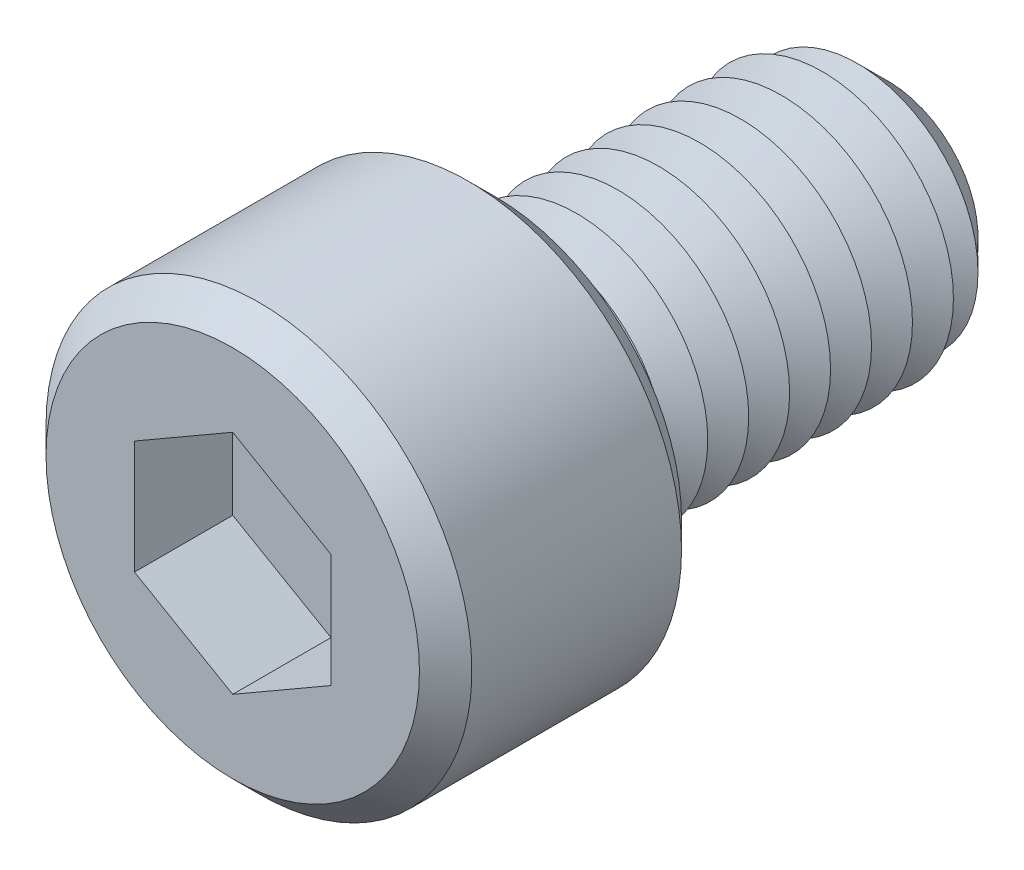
ISO-10303-21;
HEADER;
FILE_DESCRIPTION(('STEP AP214'),'2;1');
FILE_NAME('part.step','',(''),(''),'','','');
FILE_SCHEMA(('AUTOMOTIVE_DESIGN { 1 0 10303 214 1 1 1 1 }'));
ENDSEC;
DATA;
#1=APPLICATION_CONTEXT('core data for automotive mechanical design processes');
#2=APPLICATION_PROTOCOL_DEFINITION('international standard','automotive_design',2000,#1);
#3=PRODUCT_CONTEXT('',#1,'mechanical');
#4=PRODUCT('Part','Part','',(#3));
#5=PRODUCT_RELATED_PRODUCT_CATEGORY('part','',(#4));
#6=PRODUCT_DEFINITION_FORMATION('','',#4);
#7=PRODUCT_DEFINITION_CONTEXT('part definition',#1,'design');
#8=PRODUCT_DEFINITION('design','',#6,#7);
#9=PRODUCT_DEFINITION_SHAPE('','',#8);
#10=(LENGTH_UNIT() NAMED_UNIT(*) SI_UNIT(.MILLI.,.METRE.));
#11=(NAMED_UNIT(*) PLANE_ANGLE_UNIT() SI_UNIT($,.RADIAN.));
#12=(NAMED_UNIT(*) SI_UNIT($,.STERADIAN.) SOLID_ANGLE_UNIT());
#13=UNCERTAINTY_MEASURE_WITH_UNIT(LENGTH_MEASURE(1.E-05),#10,'distance_accuracy_value','');
#14=(GEOMETRIC_REPRESENTATION_CONTEXT(3) GLOBAL_UNCERTAINTY_ASSIGNED_CONTEXT((#13)) GLOBAL_UNIT_ASSIGNED_CONTEXT((#10,
#11,#12)) REPRESENTATION_CONTEXT('',''));
#15=CARTESIAN_POINT('',(0.,0.,0.));
#16=DIRECTION('',(0.,0.,1.));
#17=DIRECTION('',(1.,0.,0.));
#18=AXIS2_PLACEMENT_3D('',#15,#16,#17);
#19=CARTESIAN_POINT('',(0.,0.,8.));
#20=DIRECTION('',(0.,0.,-1.));
#21=DIRECTION('',(-1.,0.,0.));
#22=AXIS2_PLACEMENT_3D('',#19,#20,#21);
#23=CYLINDRICAL_SURFACE('',#22,6.5);
#24=CARTESIAN_POINT('',(0.,0.,0.800000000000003));
#25=DIRECTION('',(0.,0.,1.));
#26=DIRECTION('',(1.,0.,0.));
#27=AXIS2_PLACEMENT_3D('',#24,#25,#26);
#28=CIRCLE('',#27,6.5);
#29=CARTESIAN_POINT('',(6.5,0.,0.800000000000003));
#30=VERTEX_POINT('',#29);
#31=EDGE_CURVE('E248',#30,#30,#28,.T.);
#32=ORIENTED_EDGE('',*,*,#31,.T.);
#33=EDGE_LOOP('',(#32));
#34=FACE_BOUND('',#33,.T.);
#35=CARTESIAN_POINT('',(0.,0.,7.2));
#36=DIRECTION('',(0.,0.,1.));
#37=DIRECTION('',(1.,0.,0.));
#38=AXIS2_PLACEMENT_3D('',#35,#36,#37);
#39=CIRCLE('',#38,6.5);
#40=CARTESIAN_POINT('',(-6.5,0.,7.2));
#41=VERTEX_POINT('',#40);
#42=EDGE_CURVE('E241',#41,#41,#39,.F.);
#43=ORIENTED_EDGE('',*,*,#42,.T.);
#44=EDGE_LOOP('',(#43));
#45=FACE_BOUND('',#44,.T.);
#46=ADVANCED_FACE('F39',(#34,#45),#23,.T.);
#47=CARTESIAN_POINT('',(0.,0.,8.));
#48=DIRECTION('',(0.,0.,1.));
#49=DIRECTION('',(1.,0.,0.));
#50=AXIS2_PLACEMENT_3D('',#47,#48,#49);
#51=PLANE('',#50);
#52=CARTESIAN_POINT('',(0.,0.,8.));
#53=DIRECTION('',(0.,0.,1.));
#54=DIRECTION('',(1.,0.,0.));
#55=AXIS2_PLACEMENT_3D('',#52,#53,#54);
#56=CIRCLE('',#55,5.7);
#57=CARTESIAN_POINT('',(-5.7,0.,8.));
#58=VERTEX_POINT('',#57);
#59=EDGE_CURVE('E11',#58,#58,#56,.T.);
#60=ORIENTED_EDGE('',*,*,#59,.T.);
#61=EDGE_LOOP('',(#60));
#62=FACE_BOUND('',#61,.T.);
#63=DIRECTION('',(-0.866025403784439,0.5,0.));
#64=VECTOR('',#63,1.);
#65=CARTESIAN_POINT('',(3.,1.73205080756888,8.));
#66=LINE('',#65,#64);
#67=CARTESIAN_POINT('',(3.,1.73205080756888,8.));
#68=VERTEX_POINT('',#67);
#69=CARTESIAN_POINT('',(0.,3.46410161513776,8.));
#70=VERTEX_POINT('',#69);
#71=EDGE_CURVE('E55',#68,#70,#66,.T.);
#72=ORIENTED_EDGE('',*,*,#71,.F.);
#73=DIRECTION('',(0.,1.,0.));
#74=VECTOR('',#73,1.);
#75=CARTESIAN_POINT('',(3.,-1.73205080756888,8.));
#76=LINE('',#75,#74);
#77=CARTESIAN_POINT('',(3.,-1.73205080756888,8.));
#78=VERTEX_POINT('',#77);
#79=EDGE_CURVE('E151',#78,#68,#76,.T.);
#80=ORIENTED_EDGE('',*,*,#79,.F.);
#81=DIRECTION('',(0.866025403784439,0.5,0.));
#82=VECTOR('',#81,1.);
#83=CARTESIAN_POINT('',(0.,-3.46410161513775,8.));
#84=LINE('',#83,#82);
#85=CARTESIAN_POINT('',(0.,-3.46410161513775,8.));
#86=VERTEX_POINT('',#85);
#87=EDGE_CURVE('E148',#86,#78,#84,.T.);
#88=ORIENTED_EDGE('',*,*,#87,.F.);
#89=DIRECTION('',(0.866025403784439,-0.5,0.));
#90=VECTOR('',#89,1.);
#91=CARTESIAN_POINT('',(-3.,-1.73205080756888,8.));
#92=LINE('',#91,#90);
#93=CARTESIAN_POINT('',(-3.,-1.73205080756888,8.));
#94=VERTEX_POINT('',#93);
#95=EDGE_CURVE('E103',#94,#86,#92,.T.);
#96=ORIENTED_EDGE('',*,*,#95,.F.);
#97=DIRECTION('',(0.,-1.,0.));
#98=VECTOR('',#97,1.);
#99=CARTESIAN_POINT('',(-3.,1.73205080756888,8.));
#100=LINE('',#99,#98);
#101=CARTESIAN_POINT('',(-3.,1.73205080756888,8.));
#102=VERTEX_POINT('',#101);
#103=EDGE_CURVE('E142',#102,#94,#100,.T.);
#104=ORIENTED_EDGE('',*,*,#103,.F.);
#105=DIRECTION('',(-0.866025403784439,-0.5,0.));
#106=VECTOR('',#105,1.);
#107=CARTESIAN_POINT('',(0.,3.46410161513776,8.));
#108=LINE('',#107,#106);
#109=EDGE_CURVE('E137',#70,#102,#108,.T.);
#110=ORIENTED_EDGE('',*,*,#109,.F.);
#111=EDGE_LOOP('',(#72,#80,#88,#96,#104,#110));
#112=FACE_BOUND('',#111,.T.);
#113=ADVANCED_FACE('F266',(#62,#112),#51,.T.);
#114=CARTESIAN_POINT('',(0.,0.,0.));
#115=DIRECTION('',(0.,0.,1.));
#116=DIRECTION('',(1.,0.,0.));
#117=AXIS2_PLACEMENT_3D('',#114,#115,#116);
#118=PLANE('',#117);
#119=CARTESIAN_POINT('',(0.,0.,0.));
#120=DIRECTION('',(0.,0.,1.));
#121=DIRECTION('',(1.,0.,0.));
#122=AXIS2_PLACEMENT_3D('',#119,#120,#121);
#123=CIRCLE('',#122,5.69999999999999);
#124=CARTESIAN_POINT('',(5.69999999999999,0.,0.));
#125=VERTEX_POINT('',#124);
#126=EDGE_CURVE('E48',#125,#125,#123,.F.);
#127=ORIENTED_EDGE('',*,*,#126,.T.);
#128=EDGE_LOOP('',(#127));
#129=FACE_BOUND('',#128,.T.);
#130=CARTESIAN_POINT('',(0.,0.,0.));
#131=DIRECTION('',(0.,0.,1.));
#132=DIRECTION('',(1.,0.,0.));
#133=AXIS2_PLACEMENT_3D('',#130,#131,#132);
#134=CIRCLE('',#133,4.);
#135=CARTESIAN_POINT('',(4.,0.,0.));
#136=VERTEX_POINT('',#135);
#137=EDGE_CURVE('E233',#136,#136,#134,.T.);
#138=ORIENTED_EDGE('',*,*,#137,.T.);
#139=EDGE_LOOP('',(#138));
#140=FACE_BOUND('',#139,.T.);
#141=ADVANCED_FACE('F255',(#129,#140),#118,.F.);
#142=CARTESIAN_POINT('',(0.,0.,0.));
#143=DIRECTION('',(0.,0.,1.));
#144=DIRECTION('',(1.,0.,0.));
#145=AXIS2_PLACEMENT_3D('',#142,#143,#144);
#146=CONICAL_SURFACE('',#145,4.,1.0471975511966);
#147=CARTESIAN_POINT('',(0.,0.,-0.625));
#148=DIRECTION('',(0.,0.,1.));
#149=DIRECTION('',(1.,0.,0.));
#150=AXIS2_PLACEMENT_3D('',#147,#148,#149);
#151=CIRCLE('',#150,2.91746824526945);
#152=CARTESIAN_POINT('',(2.91746824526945,0.,-0.625));
#153=VERTEX_POINT('',#152);
#154=EDGE_CURVE('E229',#153,#153,#151,.T.);
#155=ORIENTED_EDGE('',*,*,#154,.T.);
#156=EDGE_LOOP('',(#155));
#157=FACE_BOUND('',#156,.T.);
#158=ORIENTED_EDGE('',*,*,#137,.F.);
#159=EDGE_LOOP('',(#158));
#160=FACE_BOUND('',#159,.T.);
#161=ADVANCED_FACE('F388',(#157,#160),#146,.T.);
#162=CARTESIAN_POINT('',(0.,0.,-0.625));
#163=DIRECTION('',(0.,0.,-1.));
#164=DIRECTION('',(-1.,0.,0.));
#165=AXIS2_PLACEMENT_3D('',#162,#163,#164);
#166=CONICAL_SURFACE('',#165,2.91746824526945,1.0471975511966);
#167=CARTESIAN_POINT('',(0.,0.,-1.25));
#168=DIRECTION('',(0.,0.,1.));
#169=DIRECTION('',(1.,0.,0.));
#170=AXIS2_PLACEMENT_3D('',#167,#168,#169);
#171=CIRCLE('',#170,4.);
#172=CARTESIAN_POINT('',(4.,0.,-1.25));
#173=VERTEX_POINT('',#172);
#174=EDGE_CURVE('E225',#173,#173,#171,.T.);
#175=ORIENTED_EDGE('',*,*,#174,.T.);
#176=EDGE_LOOP('',(#175));
#177=FACE_BOUND('',#176,.T.);
#178=ORIENTED_EDGE('',*,*,#154,.F.);
#179=EDGE_LOOP('',(#178));
#180=FACE_BOUND('',#179,.T.);
#181=ADVANCED_FACE('F384',(#177,#180),#166,.T.);
#182=CARTESIAN_POINT('',(0.,0.,-1.25));
#183=DIRECTION('',(0.,0.,1.));
#184=DIRECTION('',(1.,0.,0.));
#185=AXIS2_PLACEMENT_3D('',#182,#183,#184);
#186=CONICAL_SURFACE('',#185,4.,1.0471975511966);
#187=CARTESIAN_POINT('',(0.,0.,-1.875));
#188=DIRECTION('',(0.,0.,1.));
#189=DIRECTION('',(1.,0.,0.));
#190=AXIS2_PLACEMENT_3D('',#187,#188,#189);
#191=CIRCLE('',#190,2.91746824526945);
#192=CARTESIAN_POINT('',(2.91746824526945,0.,-1.875));
#193=VERTEX_POINT('',#192);
#194=EDGE_CURVE('E221',#193,#193,#191,.T.);
#195=ORIENTED_EDGE('',*,*,#194,.T.);
#196=EDGE_LOOP('',(#195));
#197=FACE_BOUND('',#196,.T.);
#198=ORIENTED_EDGE('',*,*,#174,.F.);
#199=EDGE_LOOP('',(#198));
#200=FACE_BOUND('',#199,.T.);
#201=ADVANCED_FACE('F380',(#197,#200),#186,.T.);
#202=CARTESIAN_POINT('',(0.,0.,-1.875));
#203=DIRECTION('',(0.,0.,-1.));
#204=DIRECTION('',(-1.,0.,0.));
#205=AXIS2_PLACEMENT_3D('',#202,#203,#204);
#206=CONICAL_SURFACE('',#205,2.91746824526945,1.0471975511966);
#207=CARTESIAN_POINT('',(0.,0.,-2.5));
#208=DIRECTION('',(0.,0.,1.));
#209=DIRECTION('',(1.,0.,0.));
#210=AXIS2_PLACEMENT_3D('',#207,#208,#209);
#211=CIRCLE('',#210,4.);
#212=CARTESIAN_POINT('',(4.,0.,-2.5));
#213=VERTEX_POINT('',#212);
#214=EDGE_CURVE('E218',#213,#213,#211,.T.);
#215=ORIENTED_EDGE('',*,*,#214,.T.);
#216=EDGE_LOOP('',(#215));
#217=FACE_BOUND('',#216,.T.);
#218=ORIENTED_EDGE('',*,*,#194,.F.);
#219=EDGE_LOOP('',(#218));
#220=FACE_BOUND('',#219,.T.);
#221=ADVANCED_FACE('F376',(#217,#220),#206,.T.);
#222=CARTESIAN_POINT('',(0.,0.,-2.5));
#223=DIRECTION('',(0.,0.,1.));
#224=DIRECTION('',(1.,0.,0.));
#225=AXIS2_PLACEMENT_3D('',#222,#223,#224);
#226=CONICAL_SURFACE('',#225,4.,1.0471975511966);
#227=CARTESIAN_POINT('',(0.,0.,-3.125));
#228=DIRECTION('',(0.,0.,1.));
#229=DIRECTION('',(1.,0.,0.));
#230=AXIS2_PLACEMENT_3D('',#227,#228,#229);
#231=CIRCLE('',#230,2.91746824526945);
#232=CARTESIAN_POINT('',(2.91746824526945,0.,-3.125));
#233=VERTEX_POINT('',#232);
#234=EDGE_CURVE('E214',#233,#233,#231,.T.);
#235=ORIENTED_EDGE('',*,*,#234,.T.);
#236=EDGE_LOOP('',(#235));
#237=FACE_BOUND('',#236,.T.);
#238=ORIENTED_EDGE('',*,*,#214,.F.);
#239=EDGE_LOOP('',(#238));
#240=FACE_BOUND('',#239,.T.);
#241=ADVANCED_FACE('F372',(#237,#240),#226,.T.);
#242=CARTESIAN_POINT('',(0.,0.,-3.125));
#243=DIRECTION('',(0.,0.,-1.));
#244=DIRECTION('',(-1.,0.,0.));
#245=AXIS2_PLACEMENT_3D('',#242,#243,#244);
#246=CONICAL_SURFACE('',#245,2.91746824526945,1.0471975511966);
#247=CARTESIAN_POINT('',(0.,0.,-3.75));
#248=DIRECTION('',(0.,0.,1.));
#249=DIRECTION('',(1.,0.,0.));
#250=AXIS2_PLACEMENT_3D('',#247,#248,#249);
#251=CIRCLE('',#250,4.);
#252=CARTESIAN_POINT('',(4.,0.,-3.75));
#253=VERTEX_POINT('',#252);
#254=EDGE_CURVE('E210',#253,#253,#251,.T.);
#255=ORIENTED_EDGE('',*,*,#254,.T.);
#256=EDGE_LOOP('',(#255));
#257=FACE_BOUND('',#256,.T.);
#258=ORIENTED_EDGE('',*,*,#234,.F.);
#259=EDGE_LOOP('',(#258));
#260=FACE_BOUND('',#259,.T.);
#261=ADVANCED_FACE('F368',(#257,#260),#246,.T.);
#262=CARTESIAN_POINT('',(0.,0.,-3.75));
#263=DIRECTION('',(0.,0.,1.));
#264=DIRECTION('',(1.,0.,0.));
#265=AXIS2_PLACEMENT_3D('',#262,#263,#264);
#266=CONICAL_SURFACE('',#265,4.,1.0471975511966);
#267=CARTESIAN_POINT('',(0.,0.,-4.375));
#268=DIRECTION('',(0.,0.,1.));
#269=DIRECTION('',(1.,0.,0.));
#270=AXIS2_PLACEMENT_3D('',#267,#268,#269);
#271=CIRCLE('',#270,2.91746824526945);
#272=CARTESIAN_POINT('',(2.91746824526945,0.,-4.375));
#273=VERTEX_POINT('',#272);
#274=EDGE_CURVE('E206',#273,#273,#271,.T.);
#275=ORIENTED_EDGE('',*,*,#274,.T.);
#276=EDGE_LOOP('',(#275));
#277=FACE_BOUND('',#276,.T.);
#278=ORIENTED_EDGE('',*,*,#254,.F.);
#279=EDGE_LOOP('',(#278));
#280=FACE_BOUND('',#279,.T.);
#281=ADVANCED_FACE('F364',(#277,#280),#266,.T.);
#282=CARTESIAN_POINT('',(0.,0.,-4.375));
#283=DIRECTION('',(0.,0.,-1.));
#284=DIRECTION('',(-1.,0.,0.));
#285=AXIS2_PLACEMENT_3D('',#282,#283,#284);
#286=CONICAL_SURFACE('',#285,2.91746824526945,1.0471975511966);
#287=CARTESIAN_POINT('',(0.,0.,-5.));
#288=DIRECTION('',(0.,0.,1.));
#289=DIRECTION('',(1.,0.,0.));
#290=AXIS2_PLACEMENT_3D('',#287,#288,#289);
#291=CIRCLE('',#290,4.);
#292=CARTESIAN_POINT('',(4.,0.,-5.));
#293=VERTEX_POINT('',#292);
#294=EDGE_CURVE('E202',#293,#293,#291,.T.);
#295=ORIENTED_EDGE('',*,*,#294,.T.);
#296=EDGE_LOOP('',(#295));
#297=FACE_BOUND('',#296,.T.);
#298=ORIENTED_EDGE('',*,*,#274,.F.);
#299=EDGE_LOOP('',(#298));
#300=FACE_BOUND('',#299,.T.);
#301=ADVANCED_FACE('F360',(#297,#300),#286,.T.);
#302=CARTESIAN_POINT('',(0.,0.,-5.));
#303=DIRECTION('',(0.,0.,1.));
#304=DIRECTION('',(1.,0.,0.));
#305=AXIS2_PLACEMENT_3D('',#302,#303,#304);
#306=CONICAL_SURFACE('',#305,4.,1.0471975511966);
#307=CARTESIAN_POINT('',(0.,0.,-5.625));
#308=DIRECTION('',(0.,0.,1.));
#309=DIRECTION('',(1.,0.,0.));
#310=AXIS2_PLACEMENT_3D('',#307,#308,#309);
#311=CIRCLE('',#310,2.91746824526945);
#312=CARTESIAN_POINT('',(2.91746824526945,0.,-5.625));
#313=VERTEX_POINT('',#312);
#314=EDGE_CURVE('E198',#313,#313,#311,.T.);
#315=ORIENTED_EDGE('',*,*,#314,.T.);
#316=EDGE_LOOP('',(#315));
#317=FACE_BOUND('',#316,.T.);
#318=ORIENTED_EDGE('',*,*,#294,.F.);
#319=EDGE_LOOP('',(#318));
#320=FACE_BOUND('',#319,.T.);
#321=ADVANCED_FACE('F356',(#317,#320),#306,.T.);
#322=CARTESIAN_POINT('',(0.,0.,-5.625));
#323=DIRECTION('',(0.,0.,-1.));
#324=DIRECTION('',(-1.,0.,0.));
#325=AXIS2_PLACEMENT_3D('',#322,#323,#324);
#326=CONICAL_SURFACE('',#325,2.91746824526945,1.0471975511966);
#327=CARTESIAN_POINT('',(0.,0.,-6.25));
#328=DIRECTION('',(0.,0.,1.));
#329=DIRECTION('',(1.,0.,0.));
#330=AXIS2_PLACEMENT_3D('',#327,#328,#329);
#331=CIRCLE('',#330,4.);
#332=CARTESIAN_POINT('',(4.,0.,-6.25));
#333=VERTEX_POINT('',#332);
#334=EDGE_CURVE('E194',#333,#333,#331,.T.);
#335=ORIENTED_EDGE('',*,*,#334,.T.);
#336=EDGE_LOOP('',(#335));
#337=FACE_BOUND('',#336,.T.);
#338=ORIENTED_EDGE('',*,*,#314,.F.);
#339=EDGE_LOOP('',(#338));
#340=FACE_BOUND('',#339,.T.);
#341=ADVANCED_FACE('F352',(#337,#340),#326,.T.);
#342=CARTESIAN_POINT('',(0.,0.,-6.25));
#343=DIRECTION('',(0.,0.,1.));
#344=DIRECTION('',(1.,0.,0.));
#345=AXIS2_PLACEMENT_3D('',#342,#343,#344);
#346=CONICAL_SURFACE('',#345,4.,1.0471975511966);
#347=CARTESIAN_POINT('',(0.,0.,-6.875));
#348=DIRECTION('',(0.,0.,1.));
#349=DIRECTION('',(1.,0.,0.));
#350=AXIS2_PLACEMENT_3D('',#347,#348,#349);
#351=CIRCLE('',#350,2.91746824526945);
#352=CARTESIAN_POINT('',(2.91746824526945,0.,-6.875));
#353=VERTEX_POINT('',#352);
#354=EDGE_CURVE('E190',#353,#353,#351,.T.);
#355=ORIENTED_EDGE('',*,*,#354,.T.);
#356=EDGE_LOOP('',(#355));
#357=FACE_BOUND('',#356,.T.);
#358=ORIENTED_EDGE('',*,*,#334,.F.);
#359=EDGE_LOOP('',(#358));
#360=FACE_BOUND('',#359,.T.);
#361=ADVANCED_FACE('F348',(#357,#360),#346,.T.);
#362=CARTESIAN_POINT('',(0.,0.,-6.875));
#363=DIRECTION('',(0.,0.,-1.));
#364=DIRECTION('',(-1.,0.,0.));
#365=AXIS2_PLACEMENT_3D('',#362,#363,#364);
#366=CONICAL_SURFACE('',#365,2.91746824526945,1.0471975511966);
#367=CARTESIAN_POINT('',(0.,0.,-7.5));
#368=DIRECTION('',(0.,0.,1.));
#369=DIRECTION('',(1.,0.,0.));
#370=AXIS2_PLACEMENT_3D('',#367,#368,#369);
#371=CIRCLE('',#370,4.);
#372=CARTESIAN_POINT('',(4.,0.,-7.5));
#373=VERTEX_POINT('',#372);
#374=EDGE_CURVE('E186',#373,#373,#371,.T.);
#375=ORIENTED_EDGE('',*,*,#374,.T.);
#376=EDGE_LOOP('',(#375));
#377=FACE_BOUND('',#376,.T.);
#378=ORIENTED_EDGE('',*,*,#354,.F.);
#379=EDGE_LOOP('',(#378));
#380=FACE_BOUND('',#379,.T.);
#381=ADVANCED_FACE('F344',(#377,#380),#366,.T.);
#382=CARTESIAN_POINT('',(0.,0.,-7.5));
#383=DIRECTION('',(0.,0.,1.));
#384=DIRECTION('',(1.,0.,0.));
#385=AXIS2_PLACEMENT_3D('',#382,#383,#384);
#386=CONICAL_SURFACE('',#385,4.,1.0471975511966);
#387=CARTESIAN_POINT('',(0.,0.,-8.125));
#388=DIRECTION('',(0.,0.,1.));
#389=DIRECTION('',(1.,0.,0.));
#390=AXIS2_PLACEMENT_3D('',#387,#388,#389);
#391=CIRCLE('',#390,2.91746824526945);
#392=CARTESIAN_POINT('',(2.91746824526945,0.,-8.125));
#393=VERTEX_POINT('',#392);
#394=EDGE_CURVE('E182',#393,#393,#391,.T.);
#395=ORIENTED_EDGE('',*,*,#394,.T.);
#396=EDGE_LOOP('',(#395));
#397=FACE_BOUND('',#396,.T.);
#398=ORIENTED_EDGE('',*,*,#374,.F.);
#399=EDGE_LOOP('',(#398));
#400=FACE_BOUND('',#399,.T.);
#401=ADVANCED_FACE('F340',(#397,#400),#386,.T.);
#402=CARTESIAN_POINT('',(0.,0.,-8.125));
#403=DIRECTION('',(0.,0.,-1.));
#404=DIRECTION('',(-1.,0.,0.));
#405=AXIS2_PLACEMENT_3D('',#402,#403,#404);
#406=CONICAL_SURFACE('',#405,2.91746824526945,1.0471975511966);
#407=CARTESIAN_POINT('',(0.,0.,-8.75));
#408=DIRECTION('',(0.,0.,1.));
#409=DIRECTION('',(1.,0.,0.));
#410=AXIS2_PLACEMENT_3D('',#407,#408,#409);
#411=CIRCLE('',#410,4.);
#412=CARTESIAN_POINT('',(4.,0.,-8.75));
#413=VERTEX_POINT('',#412);
#414=EDGE_CURVE('E178',#413,#413,#411,.T.);
#415=ORIENTED_EDGE('',*,*,#414,.T.);
#416=EDGE_LOOP('',(#415));
#417=FACE_BOUND('',#416,.T.);
#418=ORIENTED_EDGE('',*,*,#394,.F.);
#419=EDGE_LOOP('',(#418));
#420=FACE_BOUND('',#419,.T.);
#421=ADVANCED_FACE('F336',(#417,#420),#406,.T.);
#422=CARTESIAN_POINT('',(0.,0.,-8.75));
#423=DIRECTION('',(0.,0.,1.));
#424=DIRECTION('',(1.,0.,0.));
#425=AXIS2_PLACEMENT_3D('',#422,#423,#424);
#426=CONICAL_SURFACE('',#425,4.,1.0471975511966);
#427=CARTESIAN_POINT('',(0.,0.,-9.375));
#428=DIRECTION('',(0.,0.,1.));
#429=DIRECTION('',(1.,0.,0.));
#430=AXIS2_PLACEMENT_3D('',#427,#428,#429);
#431=CIRCLE('',#430,2.91746824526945);
#432=CARTESIAN_POINT('',(2.91746824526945,0.,-9.375));
#433=VERTEX_POINT('',#432);
#434=EDGE_CURVE('E174',#433,#433,#431,.T.);
#435=ORIENTED_EDGE('',*,*,#434,.T.);
#436=EDGE_LOOP('',(#435));
#437=FACE_BOUND('',#436,.T.);
#438=ORIENTED_EDGE('',*,*,#414,.F.);
#439=EDGE_LOOP('',(#438));
#440=FACE_BOUND('',#439,.T.);
#441=ADVANCED_FACE('F332',(#437,#440),#426,.T.);
#442=CARTESIAN_POINT('',(0.,0.,-9.375));
#443=DIRECTION('',(0.,0.,-1.));
#444=DIRECTION('',(-1.,0.,0.));
#445=AXIS2_PLACEMENT_3D('',#442,#443,#444);
#446=CONICAL_SURFACE('',#445,2.91746824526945,1.0471975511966);
#447=CARTESIAN_POINT('',(0.,0.,-10.));
#448=DIRECTION('',(0.,0.,1.));
#449=DIRECTION('',(1.,0.,0.));
#450=AXIS2_PLACEMENT_3D('',#447,#448,#449);
#451=CIRCLE('',#450,4.);
#452=CARTESIAN_POINT('',(4.,0.,-10.));
#453=VERTEX_POINT('',#452);
#454=EDGE_CURVE('E170',#453,#453,#451,.T.);
#455=ORIENTED_EDGE('',*,*,#454,.T.);
#456=EDGE_LOOP('',(#455));
#457=FACE_BOUND('',#456,.T.);
#458=ORIENTED_EDGE('',*,*,#434,.F.);
#459=EDGE_LOOP('',(#458));
#460=FACE_BOUND('',#459,.T.);
#461=ADVANCED_FACE('F328',(#457,#460),#446,.T.);
#462=CARTESIAN_POINT('',(0.,0.,-10.));
#463=DIRECTION('',(0.,0.,1.));
#464=DIRECTION('',(1.,0.,0.));
#465=AXIS2_PLACEMENT_3D('',#462,#463,#464);
#466=CONICAL_SURFACE('',#465,4.,1.0471975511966);
#467=CARTESIAN_POINT('',(0.,0.,-10.625));
#468=DIRECTION('',(0.,0.,1.));
#469=DIRECTION('',(1.,0.,0.));
#470=AXIS2_PLACEMENT_3D('',#467,#468,#469);
#471=CIRCLE('',#470,2.91746824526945);
#472=CARTESIAN_POINT('',(2.91746824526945,0.,-10.625));
#473=VERTEX_POINT('',#472);
#474=EDGE_CURVE('E157',#473,#473,#471,.T.);
#475=ORIENTED_EDGE('',*,*,#474,.T.);
#476=EDGE_LOOP('',(#475));
#477=FACE_BOUND('',#476,.T.);
#478=ORIENTED_EDGE('',*,*,#454,.F.);
#479=EDGE_LOOP('',(#478));
#480=FACE_BOUND('',#479,.T.);
#481=ADVANCED_FACE('F324',(#477,#480),#466,.T.);
#482=CARTESIAN_POINT('',(0.,0.,-10.625));
#483=DIRECTION('',(0.,0.,-1.));
#484=DIRECTION('',(-1.,0.,0.));
#485=AXIS2_PLACEMENT_3D('',#482,#483,#484);
#486=CONICAL_SURFACE('',#485,2.91746824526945,1.0471975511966);
#487=CARTESIAN_POINT('',(0.,0.,-11.0669872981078));
#488=DIRECTION('',(0.,0.,-1.));
#489=DIRECTION('',(-1.,0.,0.));
#490=AXIS2_PLACEMENT_3D('',#487,#488,#489);
#491=CIRCLE('',#490,3.68301270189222);
#492=CARTESIAN_POINT('',(-3.68301270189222,0.,-11.0669872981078));
#493=VERTEX_POINT('',#492);
#494=EDGE_CURVE('E173',#493,#493,#491,.T.);
#495=ORIENTED_EDGE('',*,*,#494,.F.);
#496=EDGE_LOOP('',(#495));
#497=FACE_BOUND('',#496,.T.);
#498=ORIENTED_EDGE('',*,*,#474,.F.);
#499=EDGE_LOOP('',(#498));
#500=FACE_BOUND('',#499,.T.);
#501=ADVANCED_FACE('F320',(#497,#500),#486,.T.);
#502=CARTESIAN_POINT('',(0.,0.,-12.));
#503=DIRECTION('',(0.,0.,-1.));
#504=DIRECTION('',(-1.,0.,0.));
#505=AXIS2_PLACEMENT_3D('',#502,#503,#504);
#506=PLANE('',#505);
#507=CARTESIAN_POINT('',(0.,0.,-12.));
#508=DIRECTION('',(0.,0.,-1.));
#509=DIRECTION('',(-1.,0.,0.));
#510=AXIS2_PLACEMENT_3D('',#507,#508,#509);
#511=CIRCLE('',#510,0.9);
#512=CARTESIAN_POINT('',(0.9,0.,-12.));
#513=VERTEX_POINT('',#512);
#514=EDGE_CURVE('E138',#513,#513,#511,.F.);
#515=ORIENTED_EDGE('',*,*,#514,.T.);
#516=EDGE_LOOP('',(#515));
#517=FACE_BOUND('',#516,.T.);
#518=CARTESIAN_POINT('',(0.,0.,-12.));
#519=DIRECTION('',(0.,0.,-1.));
#520=DIRECTION('',(-1.,0.,0.));
#521=AXIS2_PLACEMENT_3D('',#518,#519,#520);
#522=CIRCLE('',#521,2.75);
#523=CARTESIAN_POINT('',(-2.75,0.,-12.));
#524=VERTEX_POINT('',#523);
#525=EDGE_CURVE('E237',#524,#524,#522,.T.);
#526=ORIENTED_EDGE('',*,*,#525,.T.);
#527=EDGE_LOOP('',(#526));
#528=FACE_BOUND('',#527,.T.);
#529=ADVANCED_FACE('F323',(#517,#528),#506,.T.);
#530=CARTESIAN_POINT('',(0.,0.,-12.));
#531=DIRECTION('',(0.,0.,1.));
#532=DIRECTION('',(1.,0.,0.));
#533=AXIS2_PLACEMENT_3D('',#530,#531,#532);
#534=CONICAL_SURFACE('',#533,2.75,0.785398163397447);
#535=ORIENTED_EDGE('',*,*,#525,.F.);
#536=EDGE_LOOP('',(#535));
#537=FACE_BOUND('',#536,.T.);
#538=ORIENTED_EDGE('',*,*,#494,.T.);
#539=EDGE_LOOP('',(#538));
#540=FACE_BOUND('',#539,.T.);
#541=ADVANCED_FACE('F319',(#537,#540),#534,.T.);
#542=CARTESIAN_POINT('',(3.,1.73205080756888,5.));
#543=DIRECTION('',(0.5,0.866025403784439,0.));
#544=DIRECTION('',(-0.866025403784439,0.5,0.));
#545=AXIS2_PLACEMENT_3D('',#542,#543,#544);
#546=PLANE('',#545);
#547=ORIENTED_EDGE('',*,*,#71,.T.);
#548=DIRECTION('',(0.,0.,1.));
#549=VECTOR('',#548,1.);
#550=CARTESIAN_POINT('',(0.,3.46410161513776,5.));
#551=LINE('',#550,#549);
#552=CARTESIAN_POINT('',(0.,3.46410161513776,5.));
#553=VERTEX_POINT('',#552);
#554=EDGE_CURVE('E85',#553,#70,#551,.T.);
#555=ORIENTED_EDGE('',*,*,#554,.F.);
#556=DIRECTION('',(-0.866025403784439,0.5,0.));
#557=VECTOR('',#556,1.);
#558=CARTESIAN_POINT('',(3.,1.73205080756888,5.));
#559=LINE('',#558,#557);
#560=CARTESIAN_POINT('',(3.,1.73205080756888,5.));
#561=VERTEX_POINT('',#560);
#562=EDGE_CURVE('E154',#561,#553,#559,.T.);
#563=ORIENTED_EDGE('',*,*,#562,.F.);
#564=DIRECTION('',(0.,0.,1.));
#565=VECTOR('',#564,1.);
#566=CARTESIAN_POINT('',(3.,1.73205080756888,5.));
#567=LINE('',#566,#565);
#568=EDGE_CURVE('E63',#561,#68,#567,.T.);
#569=ORIENTED_EDGE('',*,*,#568,.T.);
#570=EDGE_LOOP('',(#547,#555,#563,#569));
#571=FACE_BOUND('',#570,.T.);
#572=ADVANCED_FACE('F309',(#571),#546,.F.);
#573=CARTESIAN_POINT('',(3.,-1.73205080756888,5.));
#574=DIRECTION('',(1.,0.,0.));
#575=DIRECTION('',(0.,1.,0.));
#576=AXIS2_PLACEMENT_3D('',#573,#574,#575);
#577=PLANE('',#576);
#578=ORIENTED_EDGE('',*,*,#79,.T.);
#579=ORIENTED_EDGE('',*,*,#568,.F.);
#580=DIRECTION('',(0.,1.,0.));
#581=VECTOR('',#580,1.);
#582=CARTESIAN_POINT('',(3.,-1.73205080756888,5.));
#583=LINE('',#582,#581);
#584=CARTESIAN_POINT('',(3.,-1.73205080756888,5.));
#585=VERTEX_POINT('',#584);
#586=EDGE_CURVE('E117',#585,#561,#583,.T.);
#587=ORIENTED_EDGE('',*,*,#586,.F.);
#588=DIRECTION('',(0.,0.,1.));
#589=VECTOR('',#588,1.);
#590=CARTESIAN_POINT('',(3.,-1.73205080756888,5.));
#591=LINE('',#590,#589);
#592=EDGE_CURVE('E108',#585,#78,#591,.T.);
#593=ORIENTED_EDGE('',*,*,#592,.T.);
#594=EDGE_LOOP('',(#578,#579,#587,#593));
#595=FACE_BOUND('',#594,.T.);
#596=ADVANCED_FACE('F306',(#595),#577,.F.);
#597=CARTESIAN_POINT('',(0.,-3.46410161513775,5.));
#598=DIRECTION('',(0.5,-0.866025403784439,0.));
#599=DIRECTION('',(0.866025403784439,0.5,0.));
#600=AXIS2_PLACEMENT_3D('',#597,#598,#599);
#601=PLANE('',#600);
#602=ORIENTED_EDGE('',*,*,#87,.T.);
#603=ORIENTED_EDGE('',*,*,#592,.F.);
#604=DIRECTION('',(0.866025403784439,0.5,0.));
#605=VECTOR('',#604,1.);
#606=CARTESIAN_POINT('',(0.,-3.46410161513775,5.));
#607=LINE('',#606,#605);
#608=CARTESIAN_POINT('',(0.,-3.46410161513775,5.));
#609=VERTEX_POINT('',#608);
#610=EDGE_CURVE('E112',#609,#585,#607,.T.);
#611=ORIENTED_EDGE('',*,*,#610,.F.);
#612=DIRECTION('',(0.,0.,1.));
#613=VECTOR('',#612,1.);
#614=CARTESIAN_POINT('',(0.,-3.46410161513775,5.));
#615=LINE('',#614,#613);
#616=EDGE_CURVE('E96',#609,#86,#615,.T.);
#617=ORIENTED_EDGE('',*,*,#616,.T.);
#618=EDGE_LOOP('',(#602,#603,#611,#617));
#619=FACE_BOUND('',#618,.T.);
#620=ADVANCED_FACE('F113',(#619),#601,.F.);
#621=CARTESIAN_POINT('',(-3.,-1.73205080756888,5.));
#622=DIRECTION('',(-0.5,-0.866025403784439,0.));
#623=DIRECTION('',(0.866025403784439,-0.5,0.));
#624=AXIS2_PLACEMENT_3D('',#621,#622,#623);
#625=PLANE('',#624);
#626=ORIENTED_EDGE('',*,*,#95,.T.);
#627=ORIENTED_EDGE('',*,*,#616,.F.);
#628=DIRECTION('',(0.866025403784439,-0.5,0.));
#629=VECTOR('',#628,1.);
#630=CARTESIAN_POINT('',(-3.,-1.73205080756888,5.));
#631=LINE('',#630,#629);
#632=CARTESIAN_POINT('',(-3.,-1.73205080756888,5.));
#633=VERTEX_POINT('',#632);
#634=EDGE_CURVE('E100',#633,#609,#631,.T.);
#635=ORIENTED_EDGE('',*,*,#634,.F.);
#636=DIRECTION('',(0.,0.,1.));
#637=VECTOR('',#636,1.);
#638=CARTESIAN_POINT('',(-3.,-1.73205080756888,5.));
#639=LINE('',#638,#637);
#640=EDGE_CURVE('E109',#633,#94,#639,.T.);
#641=ORIENTED_EDGE('',*,*,#640,.T.);
#642=EDGE_LOOP('',(#626,#627,#635,#641));
#643=FACE_BOUND('',#642,.T.);
#644=ADVANCED_FACE('F98',(#643),#625,.F.);
#645=CARTESIAN_POINT('',(-3.,1.73205080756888,5.));
#646=DIRECTION('',(-1.,0.,0.));
#647=DIRECTION('',(0.,0.,1.));
#648=AXIS2_PLACEMENT_3D('',#645,#646,#647);
#649=PLANE('',#648);
#650=ORIENTED_EDGE('',*,*,#103,.T.);
#651=ORIENTED_EDGE('',*,*,#640,.F.);
#652=DIRECTION('',(0.,-1.,0.));
#653=VECTOR('',#652,1.);
#654=CARTESIAN_POINT('',(-3.,1.73205080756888,5.));
#655=LINE('',#654,#653);
#656=CARTESIAN_POINT('',(-3.,1.73205080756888,5.));
#657=VERTEX_POINT('',#656);
#658=EDGE_CURVE('E123',#657,#633,#655,.T.);
#659=ORIENTED_EDGE('',*,*,#658,.F.);
#660=DIRECTION('',(0.,0.,1.));
#661=VECTOR('',#660,1.);
#662=CARTESIAN_POINT('',(-3.,1.73205080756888,5.));
#663=LINE('',#662,#661);
#664=EDGE_CURVE('E162',#657,#102,#663,.T.);
#665=ORIENTED_EDGE('',*,*,#664,.T.);
#666=EDGE_LOOP('',(#650,#651,#659,#665));
#667=FACE_BOUND('',#666,.T.);
#668=ADVANCED_FACE('F303',(#667),#649,.F.);
#669=CARTESIAN_POINT('',(0.,3.46410161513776,5.));
#670=DIRECTION('',(-0.5,0.866025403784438,0.));
#671=DIRECTION('',(-0.866025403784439,-0.5,0.));
#672=AXIS2_PLACEMENT_3D('',#669,#670,#671);
#673=PLANE('',#672);
#674=ORIENTED_EDGE('',*,*,#109,.T.);
#675=ORIENTED_EDGE('',*,*,#664,.F.);
#676=DIRECTION('',(-0.866025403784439,-0.5,0.));
#677=VECTOR('',#676,1.);
#678=CARTESIAN_POINT('',(0.,3.46410161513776,5.));
#679=LINE('',#678,#677);
#680=EDGE_CURVE('E129',#553,#657,#679,.T.);
#681=ORIENTED_EDGE('',*,*,#680,.F.);
#682=ORIENTED_EDGE('',*,*,#554,.T.);
#683=EDGE_LOOP('',(#674,#675,#681,#682));
#684=FACE_BOUND('',#683,.T.);
#685=ADVANCED_FACE('F281',(#684),#673,.F.);
#686=CARTESIAN_POINT('',(0.,0.,5.));
#687=DIRECTION('',(0.,0.,1.));
#688=DIRECTION('',(1.,0.,0.));
#689=AXIS2_PLACEMENT_3D('',#686,#687,#688);
#690=PLANE('',#689);
#691=CARTESIAN_POINT('',(0.,0.,5.));
#692=DIRECTION('',(0.,0.,1.));
#693=DIRECTION('',(1.,0.,0.));
#694=AXIS2_PLACEMENT_3D('',#691,#692,#693);
#695=CIRCLE('',#694,0.9);
#696=CARTESIAN_POINT('',(0.9,0.,5.));
#697=VERTEX_POINT('',#696);
#698=EDGE_CURVE('E289',#697,#697,#695,.T.);
#699=ORIENTED_EDGE('',*,*,#698,.F.);
#700=EDGE_LOOP('',(#699));
#701=FACE_BOUND('',#700,.T.);
#702=ORIENTED_EDGE('',*,*,#562,.T.);
#703=ORIENTED_EDGE('',*,*,#680,.T.);
#704=ORIENTED_EDGE('',*,*,#658,.T.);
#705=ORIENTED_EDGE('',*,*,#634,.T.);
#706=ORIENTED_EDGE('',*,*,#610,.T.);
#707=ORIENTED_EDGE('',*,*,#586,.T.);
#708=EDGE_LOOP('',(#702,#703,#704,#705,#706,#707));
#709=FACE_BOUND('',#708,.T.);
#710=ADVANCED_FACE('F120',(#701,#709),#690,.T.);
#711=CARTESIAN_POINT('',(0.,0.,-14.5455844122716));
#712=DIRECTION('',(0.,0.,1.));
#713=DIRECTION('',(1.,0.,0.));
#714=AXIS2_PLACEMENT_3D('',#711,#712,#713);
#715=CYLINDRICAL_SURFACE('',#714,0.9);
#716=CARTESIAN_POINT('',(0.9,0.,5.));
#717=CARTESIAN_POINT('',(0.9,0.,4.82291666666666));
#718=CARTESIAN_POINT('',(0.9,0.,4.64583333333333));
#719=CARTESIAN_POINT('',(0.9,0.,4.29166666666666));
#720=CARTESIAN_POINT('',(0.9,0.,4.11458333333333));
#721=CARTESIAN_POINT('',(0.9,0.,3.76041666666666));
#722=CARTESIAN_POINT('',(0.9,0.,3.58333333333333));
#723=CARTESIAN_POINT('',(0.9,0.,3.22916666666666));
#724=CARTESIAN_POINT('',(0.9,0.,3.05208333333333));
#725=CARTESIAN_POINT('',(0.9,0.,2.69791666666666));
#726=CARTESIAN_POINT('',(0.9,0.,2.52083333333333));
#727=CARTESIAN_POINT('',(0.9,0.,2.16666666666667));
#728=CARTESIAN_POINT('',(0.9,0.,1.98958333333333));
#729=CARTESIAN_POINT('',(0.9,0.,1.63541666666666));
#730=CARTESIAN_POINT('',(0.9,0.,1.45833333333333));
#731=CARTESIAN_POINT('',(0.9,0.,1.10416666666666));
#732=CARTESIAN_POINT('',(0.9,0.,0.927083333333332));
#733=CARTESIAN_POINT('',(0.9,0.,0.572916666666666));
#734=CARTESIAN_POINT('',(0.9,0.,0.395833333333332));
#735=CARTESIAN_POINT('',(0.9,0.,0.041666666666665));
#736=CARTESIAN_POINT('',(0.9,0.,-0.135416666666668));
#737=CARTESIAN_POINT('',(0.9,0.,-0.489583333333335));
#738=CARTESIAN_POINT('',(0.9,0.,-0.666666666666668));
#739=CARTESIAN_POINT('',(0.9,0.,-1.02083333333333));
#740=CARTESIAN_POINT('',(0.9,0.,-1.19791666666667));
#741=CARTESIAN_POINT('',(0.9,0.,-1.55208333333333));
#742=CARTESIAN_POINT('',(0.9,0.,-1.72916666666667));
#743=CARTESIAN_POINT('',(0.9,0.,-2.08333333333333));
#744=CARTESIAN_POINT('',(0.9,0.,-2.26041666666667));
#745=CARTESIAN_POINT('',(0.9,0.,-2.61458333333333));
#746=CARTESIAN_POINT('',(0.9,0.,-2.79166666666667));
#747=CARTESIAN_POINT('',(0.9,0.,-3.14583333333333));
#748=CARTESIAN_POINT('',(0.9,0.,-3.32291666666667));
#749=CARTESIAN_POINT('',(0.9,0.,-3.67708333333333));
#750=CARTESIAN_POINT('',(0.9,0.,-3.85416666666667));
#751=CARTESIAN_POINT('',(0.9,0.,-4.20833333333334));
#752=CARTESIAN_POINT('',(0.9,0.,-4.38541666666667));
#753=CARTESIAN_POINT('',(0.9,0.,-4.73958333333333));
#754=CARTESIAN_POINT('',(0.9,0.,-4.91666666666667));
#755=CARTESIAN_POINT('',(0.9,0.,-5.27083333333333));
#756=CARTESIAN_POINT('',(0.9,0.,-5.44791666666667));
#757=CARTESIAN_POINT('',(0.9,0.,-5.80208333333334));
#758=CARTESIAN_POINT('',(0.9,0.,-5.97916666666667));
#759=CARTESIAN_POINT('',(0.9,0.,-6.33333333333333));
#760=CARTESIAN_POINT('',(0.9,0.,-6.51041666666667));
#761=CARTESIAN_POINT('',(0.9,0.,-6.86458333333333));
#762=CARTESIAN_POINT('',(0.9,0.,-7.04166666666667));
#763=CARTESIAN_POINT('',(0.9,0.,-7.39583333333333));
#764=CARTESIAN_POINT('',(0.9,0.,-7.57291666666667));
#765=CARTESIAN_POINT('',(0.9,0.,-7.92708333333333));
#766=CARTESIAN_POINT('',(0.9,0.,-8.10416666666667));
#767=CARTESIAN_POINT('',(0.9,0.,-8.45833333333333));
#768=CARTESIAN_POINT('',(0.9,0.,-8.63541666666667));
#769=CARTESIAN_POINT('',(0.9,0.,-8.98958333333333));
#770=CARTESIAN_POINT('',(0.9,0.,-9.16666666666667));
#771=CARTESIAN_POINT('',(0.9,0.,-9.52083333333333));
#772=CARTESIAN_POINT('',(0.9,0.,-9.69791666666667));
#773=CARTESIAN_POINT('',(0.9,0.,-10.0520833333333));
#774=CARTESIAN_POINT('',(0.9,0.,-10.2291666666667));
#775=CARTESIAN_POINT('',(0.9,0.,-10.5833333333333));
#776=CARTESIAN_POINT('',(0.9,0.,-10.7604166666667));
#777=CARTESIAN_POINT('',(0.9,0.,-11.1145833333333));
#778=CARTESIAN_POINT('',(0.9,0.,-11.2916666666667));
#779=CARTESIAN_POINT('',(0.9,0.,-11.6458333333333));
#780=CARTESIAN_POINT('',(0.9,0.,-11.8229166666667));
#781=CARTESIAN_POINT('',(0.9,0.,-12.));
#782=B_SPLINE_CURVE_WITH_KNOTS('',3,(#716,#717,#718,#719,#720,#721,#722,#723,#724,#725,#726,
#727,#728,#729,#730,#731,#732,#733,#734,#735,#736,#737,#738,#739,#740,#741,#742,#743,#744,#745,
#746,#747,#748,#749,#750,#751,#752,#753,#754,#755,#756,#757,#758,#759,#760,#761,#762,#763,#764,
#765,#766,#767,#768,#769,#770,#771,#772,#773,#774,#775,#776,#777,#778,#779,#780,#781),
.UNSPECIFIED.,.F.,.F.,(4,2,2,2,2,2,2,2,2,2,2,2,2,2,2,2,2,2,2,2,2,2,2,2,2,2,2,2,2,2,2,2,4),(0.,
0.53125,1.0625,1.59375,2.125,2.65625,3.1875,3.71875,4.25,4.78125,5.3125,5.84375,6.375,6.90625,
7.4375,7.96875,8.5,9.03125,9.5625,10.09375,10.625,11.15625,11.6875,12.21875,12.75,13.28125,
13.8125,14.34375,14.875,15.40625,15.9375,16.46875,17.),.UNSPECIFIED.);
#783=EDGE_CURVE('BSEAM261',#697,#513,#782,.T.);
#784=ORIENTED_EDGE('',*,*,#698,.T.);
#785=ORIENTED_EDGE('',*,*,#514,.F.);
#786=ORIENTED_EDGE('',*,*,#783,.T.);
#787=ORIENTED_EDGE('',*,*,#783,.F.);
#788=EDGE_LOOP('',(#784,#786,#785,#787));
#789=FACE_BOUND('',#788,.T.);
#790=ADVANCED_FACE('F261',(#789),#715,.F.);
#791=CARTESIAN_POINT('',(0.,0.,0.800000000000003));
#792=DIRECTION('',(0.,0.,1.));
#793=DIRECTION('',(1.,0.,0.));
#794=AXIS2_PLACEMENT_3D('',#791,#792,#793);
#795=CONICAL_SURFACE('',#794,6.5,0.78539816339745);
#796=ORIENTED_EDGE('',*,*,#126,.F.);
#797=EDGE_LOOP('',(#796));
#798=FACE_BOUND('',#797,.T.);
#799=ORIENTED_EDGE('',*,*,#31,.F.);
#800=EDGE_LOOP('',(#799));
#801=FACE_BOUND('',#800,.T.);
#802=ADVANCED_FACE('F258',(#798,#801),#795,.T.);
#803=CARTESIAN_POINT('',(0.,0.,8.));
#804=DIRECTION('',(0.,0.,-1.));
#805=DIRECTION('',(-1.,0.,0.));
#806=AXIS2_PLACEMENT_3D('',#803,#804,#805);
#807=CONICAL_SURFACE('',#806,5.7,0.785398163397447);
#808=CARTESIAN_POINT('',(-6.5,0.,7.2));
#809=CARTESIAN_POINT('',(-6.49166666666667,0.,7.20833333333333));
#810=CARTESIAN_POINT('',(-6.48333333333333,0.,7.21666666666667));
#811=CARTESIAN_POINT('',(-6.46666666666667,0.,7.23333333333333));
#812=CARTESIAN_POINT('',(-6.45833333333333,0.,7.24166666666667));
#813=CARTESIAN_POINT('',(-6.44166666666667,0.,7.25833333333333));
#814=CARTESIAN_POINT('',(-6.43333333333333,0.,7.26666666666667));
#815=CARTESIAN_POINT('',(-6.41666666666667,0.,7.28333333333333));
#816=CARTESIAN_POINT('',(-6.40833333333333,0.,7.29166666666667));
#817=CARTESIAN_POINT('',(-6.39166666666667,0.,7.30833333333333));
#818=CARTESIAN_POINT('',(-6.38333333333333,0.,7.31666666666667));
#819=CARTESIAN_POINT('',(-6.36666666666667,0.,7.33333333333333));
#820=CARTESIAN_POINT('',(-6.35833333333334,0.,7.34166666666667));
#821=CARTESIAN_POINT('',(-6.34166666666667,0.,7.35833333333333));
#822=CARTESIAN_POINT('',(-6.33333333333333,0.,7.36666666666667));
#823=CARTESIAN_POINT('',(-6.31666666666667,0.,7.38333333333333));
#824=CARTESIAN_POINT('',(-6.30833333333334,0.,7.39166666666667));
#825=CARTESIAN_POINT('',(-6.29166666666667,0.,7.40833333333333));
#826=CARTESIAN_POINT('',(-6.28333333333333,0.,7.41666666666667));
#827=CARTESIAN_POINT('',(-6.26666666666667,0.,7.43333333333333));
#828=CARTESIAN_POINT('',(-6.25833333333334,0.,7.44166666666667));
#829=CARTESIAN_POINT('',(-6.24166666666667,0.,7.45833333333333));
#830=CARTESIAN_POINT('',(-6.23333333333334,0.,7.46666666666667));
#831=CARTESIAN_POINT('',(-6.21666666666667,0.,7.48333333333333));
#832=CARTESIAN_POINT('',(-6.20833333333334,0.,7.49166666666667));
#833=CARTESIAN_POINT('',(-6.19166666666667,0.,7.50833333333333));
#834=CARTESIAN_POINT('',(-6.18333333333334,0.,7.51666666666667));
#835=CARTESIAN_POINT('',(-6.16666666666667,0.,7.53333333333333));
#836=CARTESIAN_POINT('',(-6.15833333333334,0.,7.54166666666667));
#837=CARTESIAN_POINT('',(-6.14166666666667,0.,7.55833333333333));
#838=CARTESIAN_POINT('',(-6.13333333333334,0.,7.56666666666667));
#839=CARTESIAN_POINT('',(-6.11666666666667,0.,7.58333333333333));
#840=CARTESIAN_POINT('',(-6.10833333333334,0.,7.59166666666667));
#841=CARTESIAN_POINT('',(-6.09166666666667,0.,7.60833333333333));
#842=CARTESIAN_POINT('',(-6.08333333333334,0.,7.61666666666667));
#843=CARTESIAN_POINT('',(-6.06666666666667,0.,7.63333333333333));
#844=CARTESIAN_POINT('',(-6.05833333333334,0.,7.64166666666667));
#845=CARTESIAN_POINT('',(-6.04166666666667,0.,7.65833333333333));
#846=CARTESIAN_POINT('',(-6.03333333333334,0.,7.66666666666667));
#847=CARTESIAN_POINT('',(-6.01666666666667,0.,7.68333333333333));
#848=CARTESIAN_POINT('',(-6.00833333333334,0.,7.69166666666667));
#849=CARTESIAN_POINT('',(-5.99166666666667,0.,7.70833333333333));
#850=CARTESIAN_POINT('',(-5.98333333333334,0.,7.71666666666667));
#851=CARTESIAN_POINT('',(-5.96666666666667,0.,7.73333333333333));
#852=CARTESIAN_POINT('',(-5.95833333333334,0.,7.74166666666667));
#853=CARTESIAN_POINT('',(-5.94166666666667,0.,7.75833333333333));
#854=CARTESIAN_POINT('',(-5.93333333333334,0.,7.76666666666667));
#855=CARTESIAN_POINT('',(-5.91666666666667,0.,7.78333333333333));
#856=CARTESIAN_POINT('',(-5.90833333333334,0.,7.79166666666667));
#857=CARTESIAN_POINT('',(-5.89166666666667,0.,7.80833333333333));
#858=CARTESIAN_POINT('',(-5.88333333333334,0.,7.81666666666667));
#859=CARTESIAN_POINT('',(-5.86666666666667,0.,7.83333333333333));
#860=CARTESIAN_POINT('',(-5.85833333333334,0.,7.84166666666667));
#861=CARTESIAN_POINT('',(-5.84166666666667,0.,7.85833333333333));
#862=CARTESIAN_POINT('',(-5.83333333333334,0.,7.86666666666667));
#863=CARTESIAN_POINT('',(-5.81666666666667,0.,7.88333333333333));
#864=CARTESIAN_POINT('',(-5.80833333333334,0.,7.89166666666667));
#865=CARTESIAN_POINT('',(-5.79166666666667,0.,7.90833333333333));
#866=CARTESIAN_POINT('',(-5.78333333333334,0.,7.91666666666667));
#867=CARTESIAN_POINT('',(-5.76666666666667,0.,7.93333333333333));
#868=CARTESIAN_POINT('',(-5.75833333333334,0.,7.94166666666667));
#869=CARTESIAN_POINT('',(-5.74166666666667,0.,7.95833333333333));
#870=CARTESIAN_POINT('',(-5.73333333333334,0.,7.96666666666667));
#871=CARTESIAN_POINT('',(-5.71666666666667,0.,7.98333333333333));
#872=CARTESIAN_POINT('',(-5.70833333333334,0.,7.99166666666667));
#873=CARTESIAN_POINT('',(-5.7,0.,8.));
#874=B_SPLINE_CURVE_WITH_KNOTS('',3,(#808,#809,#810,#811,#812,#813,#814,#815,#816,#817,#818,
#819,#820,#821,#822,#823,#824,#825,#826,#827,#828,#829,#830,#831,#832,#833,#834,#835,#836,#837,
#838,#839,#840,#841,#842,#843,#844,#845,#846,#847,#848,#849,#850,#851,#852,#853,#854,#855,#856,
#857,#858,#859,#860,#861,#862,#863,#864,#865,#866,#867,#868,#869,#870,#871,#872,#873),
.UNSPECIFIED.,.F.,.F.,(4,2,2,2,2,2,2,2,2,2,2,2,2,2,2,2,2,2,2,2,2,2,2,2,2,2,2,2,2,2,2,2,4),(0.,
0.0353553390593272,0.0707106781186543,0.106066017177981,0.141421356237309,0.176776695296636,
0.212132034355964,0.247487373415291,0.282842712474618,0.318198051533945,0.353553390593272,
0.388908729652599,0.424264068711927,0.459619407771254,0.494974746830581,0.530330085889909,
0.565685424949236,0.601040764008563,0.63639610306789,0.671751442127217,0.707106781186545,
0.742462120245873,0.7778174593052,0.813172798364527,0.848528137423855,0.883883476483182,
0.919238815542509,0.954594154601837,0.989949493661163,1.02530483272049,1.06066017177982,
1.09601551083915,1.13137084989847),.UNSPECIFIED.);
#875=EDGE_CURVE('BSEAM41',#41,#58,#874,.T.);
#876=ORIENTED_EDGE('',*,*,#42,.F.);
#877=ORIENTED_EDGE('',*,*,#59,.F.);
#878=ORIENTED_EDGE('',*,*,#875,.T.);
#879=ORIENTED_EDGE('',*,*,#875,.F.);
#880=EDGE_LOOP('',(#876,#878,#877,#879));
#881=FACE_BOUND('',#880,.T.);
#882=ADVANCED_FACE('F41',(#881),#807,.T.);
#883=CLOSED_SHELL('',(#46,#113,#141,#161,#181,#201,#221,#241,#261,#281,#301,#321,#341,#361,#381,
#401,#421,#441,#461,#481,#501,#529,#541,#572,#596,#620,#644,#668,#685,#710,#790,#802,#882));
#884=MANIFOLD_SOLID_BREP('B2',#883);
#885=ADVANCED_BREP_SHAPE_REPRESENTATION('',(#18,#884),#14);
#886=SHAPE_DEFINITION_REPRESENTATION(#9,#885);
ENDSEC;
END-ISO-10303-21;
